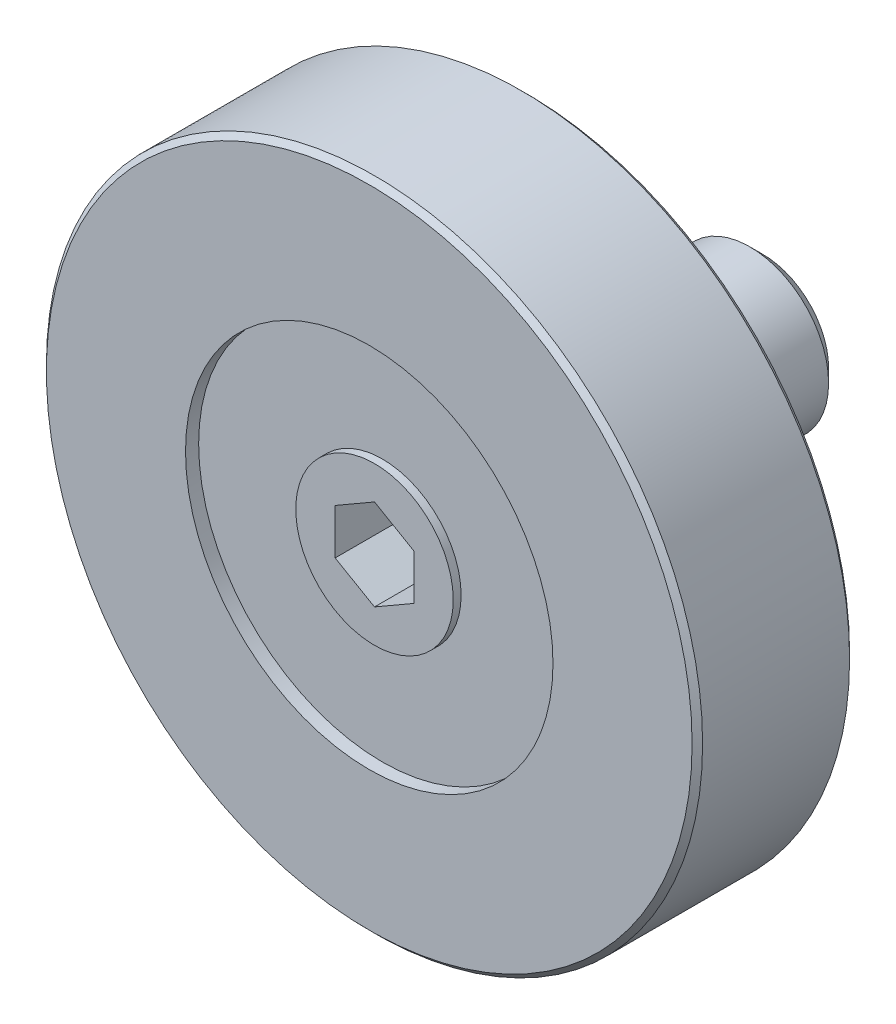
ISO-10303-21;
HEADER;
FILE_DESCRIPTION(('STEP AP214'),'2;1');
FILE_NAME('part.step','',(''),(''),'','','');
FILE_SCHEMA(('AUTOMOTIVE_DESIGN { 1 0 10303 214 1 1 1 1 }'));
ENDSEC;
DATA;
#1=APPLICATION_CONTEXT('core data for automotive mechanical design processes');
#2=APPLICATION_PROTOCOL_DEFINITION('international standard','automotive_design',2000,#1);
#3=PRODUCT_CONTEXT('',#1,'mechanical');
#4=PRODUCT('Part','Part','',(#3));
#5=PRODUCT_RELATED_PRODUCT_CATEGORY('part','',(#4));
#6=PRODUCT_DEFINITION_FORMATION('','',#4);
#7=PRODUCT_DEFINITION_CONTEXT('part definition',#1,'design');
#8=PRODUCT_DEFINITION('design','',#6,#7);
#9=PRODUCT_DEFINITION_SHAPE('','',#8);
#10=(LENGTH_UNIT() NAMED_UNIT(*) SI_UNIT(.MILLI.,.METRE.));
#11=(NAMED_UNIT(*) PLANE_ANGLE_UNIT() SI_UNIT($,.RADIAN.));
#12=(NAMED_UNIT(*) SI_UNIT($,.STERADIAN.) SOLID_ANGLE_UNIT());
#13=UNCERTAINTY_MEASURE_WITH_UNIT(LENGTH_MEASURE(1.E-05),#10,'distance_accuracy_value','');
#14=(GEOMETRIC_REPRESENTATION_CONTEXT(3) GLOBAL_UNCERTAINTY_ASSIGNED_CONTEXT((#13)) GLOBAL_UNIT_ASSIGNED_CONTEXT((#10,
#11,#12)) REPRESENTATION_CONTEXT('',''));
#15=CARTESIAN_POINT('',(0.,0.,0.));
#16=DIRECTION('',(0.,0.,1.));
#17=DIRECTION('',(1.,0.,0.));
#18=AXIS2_PLACEMENT_3D('',#15,#16,#17);
#19=CARTESIAN_POINT('',(0.,0.,-8.00000000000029));
#20=DIRECTION('',(0.,0.,1.));
#21=DIRECTION('',(1.,0.,0.));
#22=AXIS2_PLACEMENT_3D('',#19,#20,#21);
#23=PLANE('',#22);
#24=CARTESIAN_POINT('',(0.,0.,-8.00000000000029));
#25=DIRECTION('',(0.,0.,1.));
#26=DIRECTION('',(1.,0.,0.));
#27=AXIS2_PLACEMENT_3D('',#24,#25,#26);
#28=CIRCLE('',#27,2.49999999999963);
#29=CARTESIAN_POINT('',(2.49999999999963,0.,-8.00000000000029));
#30=VERTEX_POINT('',#29);
#31=EDGE_CURVE('E9',#30,#30,#28,.T.);
#32=ORIENTED_EDGE('',*,*,#31,.F.);
#33=EDGE_LOOP('',(#32));
#34=FACE_BOUND('',#33,.T.);
#35=ADVANCED_FACE('F14',(#34),#23,.F.);
#36=CARTESIAN_POINT('',(0.,0.,-8.00000000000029));
#37=DIRECTION('',(0.,0.,1.));
#38=DIRECTION('',(1.,0.,0.));
#39=AXIS2_PLACEMENT_3D('',#36,#37,#38);
#40=CONICAL_SURFACE('',#39,2.49999999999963,0.785398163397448);
#41=CARTESIAN_POINT('',(0.,0.,-7.50000000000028));
#42=DIRECTION('',(0.,0.,1.));
#43=DIRECTION('',(1.,0.,0.));
#44=AXIS2_PLACEMENT_3D('',#41,#42,#43);
#45=CIRCLE('',#44,2.99999999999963);
#46=CARTESIAN_POINT('',(2.99999999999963,0.,-7.50000000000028));
#47=VERTEX_POINT('',#46);
#48=EDGE_CURVE('E21',#47,#47,#45,.T.);
#49=ORIENTED_EDGE('',*,*,#48,.F.);
#50=EDGE_LOOP('',(#49));
#51=FACE_BOUND('',#50,.T.);
#52=ORIENTED_EDGE('',*,*,#31,.T.);
#53=EDGE_LOOP('',(#52));
#54=FACE_BOUND('',#53,.T.);
#55=ADVANCED_FACE('F169',(#51,#54),#40,.T.);
#56=CARTESIAN_POINT('',(0.,0.,10.));
#57=DIRECTION('',(0.,0.,1.));
#58=DIRECTION('',(1.,0.,0.));
#59=AXIS2_PLACEMENT_3D('',#56,#57,#58);
#60=CYLINDRICAL_SURFACE('',#59,2.99999999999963);
#61=CARTESIAN_POINT('',(0.,0.,-2.00000000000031));
#62=DIRECTION('',(0.,0.,1.));
#63=DIRECTION('',(1.,0.,0.));
#64=AXIS2_PLACEMENT_3D('',#61,#62,#63);
#65=CIRCLE('',#64,2.99999999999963);
#66=CARTESIAN_POINT('',(2.99999999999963,0.,-2.00000000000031));
#67=VERTEX_POINT('',#66);
#68=EDGE_CURVE('E162',#67,#67,#65,.T.);
#69=ORIENTED_EDGE('',*,*,#68,.F.);
#70=EDGE_LOOP('',(#69));
#71=FACE_BOUND('',#70,.T.);
#72=ORIENTED_EDGE('',*,*,#48,.T.);
#73=EDGE_LOOP('',(#72));
#74=FACE_BOUND('',#73,.T.);
#75=ADVANCED_FACE('F167',(#71,#74),#60,.T.);
#76=CARTESIAN_POINT('',(0.,2.34999999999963,-2.00000000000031));
#77=DIRECTION('',(0.,0.,-1.));
#78=DIRECTION('',(-1.,0.,0.));
#79=AXIS2_PLACEMENT_3D('',#76,#77,#78);
#80=PLANE('',#79);
#81=CARTESIAN_POINT('',(0.,0.,-2.00000000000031));
#82=DIRECTION('',(0.,0.,1.));
#83=DIRECTION('',(1.,0.,0.));
#84=AXIS2_PLACEMENT_3D('',#81,#82,#83);
#85=CIRCLE('',#84,2.34999999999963);
#86=CARTESIAN_POINT('',(2.34999999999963,0.,-2.00000000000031));
#87=VERTEX_POINT('',#86);
#88=EDGE_CURVE('E159',#87,#87,#85,.T.);
#89=ORIENTED_EDGE('',*,*,#88,.F.);
#90=EDGE_LOOP('',(#89));
#91=FACE_BOUND('',#90,.T.);
#92=ORIENTED_EDGE('',*,*,#68,.T.);
#93=EDGE_LOOP('',(#92));
#94=FACE_BOUND('',#93,.T.);
#95=ADVANCED_FACE('F194',(#91,#94),#80,.F.);
#96=CARTESIAN_POINT('',(0.,0.,10.));
#97=DIRECTION('',(0.,0.,1.));
#98=DIRECTION('',(1.,0.,0.));
#99=AXIS2_PLACEMENT_3D('',#96,#97,#98);
#100=CYLINDRICAL_SURFACE('',#99,2.34999999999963);
#101=CARTESIAN_POINT('',(0.,0.,-3.05311331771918E-13));
#102=DIRECTION('',(0.,0.,1.));
#103=DIRECTION('',(1.,0.,0.));
#104=AXIS2_PLACEMENT_3D('',#101,#102,#103);
#105=CIRCLE('',#104,2.34999999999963);
#106=CARTESIAN_POINT('',(2.34999999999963,0.,-3.05311331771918E-13));
#107=VERTEX_POINT('',#106);
#108=EDGE_CURVE('E156',#107,#107,#105,.T.);
#109=ORIENTED_EDGE('',*,*,#108,.F.);
#110=EDGE_LOOP('',(#109));
#111=FACE_BOUND('',#110,.T.);
#112=ORIENTED_EDGE('',*,*,#88,.T.);
#113=EDGE_LOOP('',(#112));
#114=FACE_BOUND('',#113,.T.);
#115=ADVANCED_FACE('F203',(#111,#114),#100,.T.);
#116=CARTESIAN_POINT('',(0.,3.99999999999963,-3.05311331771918E-13));
#117=DIRECTION('',(0.,0.,1.));
#118=DIRECTION('',(1.,0.,0.));
#119=AXIS2_PLACEMENT_3D('',#116,#117,#118);
#120=PLANE('',#119);
#121=CARTESIAN_POINT('',(0.,0.,-3.05311331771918E-13));
#122=DIRECTION('',(0.,0.,1.));
#123=DIRECTION('',(1.,0.,0.));
#124=AXIS2_PLACEMENT_3D('',#121,#122,#123);
#125=CIRCLE('',#124,3.99999999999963);
#126=CARTESIAN_POINT('',(3.99999999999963,0.,-3.05311331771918E-13));
#127=VERTEX_POINT('',#126);
#128=EDGE_CURVE('E153',#127,#127,#125,.T.);
#129=ORIENTED_EDGE('',*,*,#128,.F.);
#130=EDGE_LOOP('',(#129));
#131=FACE_BOUND('',#130,.T.);
#132=ORIENTED_EDGE('',*,*,#108,.T.);
#133=EDGE_LOOP('',(#132));
#134=FACE_BOUND('',#133,.T.);
#135=ADVANCED_FACE('F212',(#131,#134),#120,.F.);
#136=CARTESIAN_POINT('',(0.,0.,10.));
#137=DIRECTION('',(0.,0.,1.));
#138=DIRECTION('',(1.,0.,0.));
#139=AXIS2_PLACEMENT_3D('',#136,#137,#138);
#140=CYLINDRICAL_SURFACE('',#139,3.99999999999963);
#141=CARTESIAN_POINT('',(0.,0.,1.49999999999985));
#142=DIRECTION('',(0.,0.,1.));
#143=DIRECTION('',(1.,0.,0.));
#144=AXIS2_PLACEMENT_3D('',#141,#142,#143);
#145=CIRCLE('',#144,3.99999999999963);
#146=CARTESIAN_POINT('',(3.99999999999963,0.,1.49999999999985));
#147=VERTEX_POINT('',#146);
#148=EDGE_CURVE('E150',#147,#147,#145,.T.);
#149=ORIENTED_EDGE('',*,*,#148,.F.);
#150=EDGE_LOOP('',(#149));
#151=FACE_BOUND('',#150,.T.);
#152=ORIENTED_EDGE('',*,*,#128,.T.);
#153=EDGE_LOOP('',(#152));
#154=FACE_BOUND('',#153,.T.);
#155=ADVANCED_FACE('F221',(#151,#154),#140,.T.);
#156=CARTESIAN_POINT('',(0.,3.99999999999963,1.49999999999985));
#157=DIRECTION('',(0.,0.,1.));
#158=DIRECTION('',(1.,0.,0.));
#159=AXIS2_PLACEMENT_3D('',#156,#157,#158);
#160=PLANE('',#159);
#161=CARTESIAN_POINT('',(0.,0.,1.49999999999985));
#162=DIRECTION('',(0.,0.,1.));
#163=DIRECTION('',(1.,0.,0.));
#164=AXIS2_PLACEMENT_3D('',#161,#162,#163);
#165=CIRCLE('',#164,6.99999999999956);
#166=CARTESIAN_POINT('',(6.99999999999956,0.,1.49999999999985));
#167=VERTEX_POINT('',#166);
#168=EDGE_CURVE('E147',#167,#167,#165,.T.);
#169=ORIENTED_EDGE('',*,*,#168,.F.);
#170=EDGE_LOOP('',(#169));
#171=FACE_BOUND('',#170,.T.);
#172=ORIENTED_EDGE('',*,*,#148,.T.);
#173=EDGE_LOOP('',(#172));
#174=FACE_BOUND('',#173,.T.);
#175=ADVANCED_FACE('F230',(#171,#174),#160,.F.);
#176=CARTESIAN_POINT('',(0.,0.,10.));
#177=DIRECTION('',(0.,0.,1.));
#178=DIRECTION('',(1.,0.,0.));
#179=AXIS2_PLACEMENT_3D('',#176,#177,#178);
#180=CYLINDRICAL_SURFACE('',#179,6.99999999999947);
#181=CARTESIAN_POINT('',(0.,0.,0.999999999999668));
#182=DIRECTION('',(0.,0.,1.));
#183=DIRECTION('',(1.,0.,0.));
#184=AXIS2_PLACEMENT_3D('',#181,#182,#183);
#185=CIRCLE('',#184,6.99999999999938);
#186=CARTESIAN_POINT('',(6.99999999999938,0.,0.999999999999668));
#187=VERTEX_POINT('',#186);
#188=EDGE_CURVE('E144',#187,#187,#185,.T.);
#189=ORIENTED_EDGE('',*,*,#188,.F.);
#190=EDGE_LOOP('',(#189));
#191=FACE_BOUND('',#190,.T.);
#192=ORIENTED_EDGE('',*,*,#168,.T.);
#193=EDGE_LOOP('',(#192));
#194=FACE_BOUND('',#193,.T.);
#195=ADVANCED_FACE('F239',(#191,#194),#180,.F.);
#196=CARTESIAN_POINT('',(0.,12.2999999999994,0.999999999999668));
#197=DIRECTION('',(0.,0.,1.));
#198=DIRECTION('',(1.,0.,0.));
#199=AXIS2_PLACEMENT_3D('',#196,#197,#198);
#200=PLANE('',#199);
#201=CARTESIAN_POINT('',(0.,0.,0.999999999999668));
#202=DIRECTION('',(0.,0.,1.));
#203=DIRECTION('',(1.,0.,0.));
#204=AXIS2_PLACEMENT_3D('',#201,#202,#203);
#205=CIRCLE('',#204,12.2999999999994);
#206=CARTESIAN_POINT('',(12.2999999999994,0.,0.999999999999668));
#207=VERTEX_POINT('',#206);
#208=EDGE_CURVE('E141',#207,#207,#205,.T.);
#209=ORIENTED_EDGE('',*,*,#208,.F.);
#210=EDGE_LOOP('',(#209));
#211=FACE_BOUND('',#210,.T.);
#212=ORIENTED_EDGE('',*,*,#188,.T.);
#213=EDGE_LOOP('',(#212));
#214=FACE_BOUND('',#213,.T.);
#215=ADVANCED_FACE('F248',(#211,#214),#200,.F.);
#216=CARTESIAN_POINT('',(0.,0.,0.999999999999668));
#217=DIRECTION('',(0.,0.,1.));
#218=DIRECTION('',(1.,0.,0.));
#219=AXIS2_PLACEMENT_3D('',#216,#217,#218);
#220=CONICAL_SURFACE('',#219,12.2999999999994,0.785398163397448);
#221=CARTESIAN_POINT('',(0.,0.,1.2));
#222=DIRECTION('',(0.,0.,1.));
#223=DIRECTION('',(1.,0.,0.));
#224=AXIS2_PLACEMENT_3D('',#221,#222,#223);
#225=CIRCLE('',#224,12.4999999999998);
#226=CARTESIAN_POINT('',(12.4999999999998,0.,1.2));
#227=VERTEX_POINT('',#226);
#228=EDGE_CURVE('E138',#227,#227,#225,.T.);
#229=ORIENTED_EDGE('',*,*,#228,.F.);
#230=EDGE_LOOP('',(#229));
#231=FACE_BOUND('',#230,.T.);
#232=ORIENTED_EDGE('',*,*,#208,.T.);
#233=EDGE_LOOP('',(#232));
#234=FACE_BOUND('',#233,.T.);
#235=ADVANCED_FACE('F257',(#231,#234),#220,.T.);
#236=CARTESIAN_POINT('',(0.,0.,10.));
#237=DIRECTION('',(0.,0.,1.));
#238=DIRECTION('',(1.,0.,0.));
#239=AXIS2_PLACEMENT_3D('',#236,#237,#238);
#240=CYLINDRICAL_SURFACE('',#239,12.4999999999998);
#241=CARTESIAN_POINT('',(0.,0.,6.8));
#242=DIRECTION('',(0.,0.,1.));
#243=DIRECTION('',(1.,0.,0.));
#244=AXIS2_PLACEMENT_3D('',#241,#242,#243);
#245=CIRCLE('',#244,12.4999999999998);
#246=CARTESIAN_POINT('',(12.4999999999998,0.,6.8));
#247=VERTEX_POINT('',#246);
#248=EDGE_CURVE('E135',#247,#247,#245,.T.);
#249=ORIENTED_EDGE('',*,*,#248,.F.);
#250=EDGE_LOOP('',(#249));
#251=FACE_BOUND('',#250,.T.);
#252=ORIENTED_EDGE('',*,*,#228,.T.);
#253=EDGE_LOOP('',(#252));
#254=FACE_BOUND('',#253,.T.);
#255=ADVANCED_FACE('F266',(#251,#254),#240,.T.);
#256=CARTESIAN_POINT('',(0.,0.,6.8));
#257=DIRECTION('',(0.,0.,-1.));
#258=DIRECTION('',(-1.,0.,0.));
#259=AXIS2_PLACEMENT_3D('',#256,#257,#258);
#260=CONICAL_SURFACE('',#259,12.4999999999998,0.785398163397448);
#261=CARTESIAN_POINT('',(0.,0.,7.));
#262=DIRECTION('',(0.,0.,1.));
#263=DIRECTION('',(1.,0.,0.));
#264=AXIS2_PLACEMENT_3D('',#261,#262,#263);
#265=CIRCLE('',#264,12.2999999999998);
#266=CARTESIAN_POINT('',(12.2999999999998,0.,7.));
#267=VERTEX_POINT('',#266);
#268=EDGE_CURVE('E132',#267,#267,#265,.T.);
#269=ORIENTED_EDGE('',*,*,#268,.F.);
#270=EDGE_LOOP('',(#269));
#271=FACE_BOUND('',#270,.T.);
#272=ORIENTED_EDGE('',*,*,#248,.T.);
#273=EDGE_LOOP('',(#272));
#274=FACE_BOUND('',#273,.T.);
#275=ADVANCED_FACE('F275',(#271,#274),#260,.T.);
#276=CARTESIAN_POINT('',(0.,12.2999999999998,7.));
#277=DIRECTION('',(0.,0.,-1.));
#278=DIRECTION('',(-1.,0.,0.));
#279=AXIS2_PLACEMENT_3D('',#276,#277,#278);
#280=PLANE('',#279);
#281=CARTESIAN_POINT('',(0.,0.,7.));
#282=DIRECTION('',(0.,0.,1.));
#283=DIRECTION('',(1.,0.,0.));
#284=AXIS2_PLACEMENT_3D('',#281,#282,#283);
#285=CIRCLE('',#284,6.99999999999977);
#286=CARTESIAN_POINT('',(6.99999999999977,0.,7.));
#287=VERTEX_POINT('',#286);
#288=EDGE_CURVE('E129',#287,#287,#285,.T.);
#289=ORIENTED_EDGE('',*,*,#288,.F.);
#290=EDGE_LOOP('',(#289));
#291=FACE_BOUND('',#290,.T.);
#292=ORIENTED_EDGE('',*,*,#268,.T.);
#293=EDGE_LOOP('',(#292));
#294=FACE_BOUND('',#293,.T.);
#295=ADVANCED_FACE('F284',(#291,#294),#280,.F.);
#296=CARTESIAN_POINT('',(0.,0.,10.));
#297=DIRECTION('',(0.,0.,1.));
#298=DIRECTION('',(1.,0.,0.));
#299=AXIS2_PLACEMENT_3D('',#296,#297,#298);
#300=CYLINDRICAL_SURFACE('',#299,6.99999999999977);
#301=CARTESIAN_POINT('',(0.,0.,6.5));
#302=DIRECTION('',(0.,0.,1.));
#303=DIRECTION('',(1.,0.,0.));
#304=AXIS2_PLACEMENT_3D('',#301,#302,#303);
#305=CIRCLE('',#304,6.99999999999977);
#306=CARTESIAN_POINT('',(6.99999999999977,0.,6.5));
#307=VERTEX_POINT('',#306);
#308=EDGE_CURVE('E126',#307,#307,#305,.T.);
#309=ORIENTED_EDGE('',*,*,#308,.F.);
#310=EDGE_LOOP('',(#309));
#311=FACE_BOUND('',#310,.T.);
#312=ORIENTED_EDGE('',*,*,#288,.T.);
#313=EDGE_LOOP('',(#312));
#314=FACE_BOUND('',#313,.T.);
#315=ADVANCED_FACE('F293',(#311,#314),#300,.F.);
#316=CARTESIAN_POINT('',(0.,3.,6.5));
#317=DIRECTION('',(0.,0.,-1.));
#318=DIRECTION('',(-1.,0.,0.));
#319=AXIS2_PLACEMENT_3D('',#316,#317,#318);
#320=PLANE('',#319);
#321=CARTESIAN_POINT('',(0.,0.,6.5));
#322=DIRECTION('',(0.,0.,1.));
#323=DIRECTION('',(1.,0.,0.));
#324=AXIS2_PLACEMENT_3D('',#321,#322,#323);
#325=CIRCLE('',#324,3.);
#326=CARTESIAN_POINT('',(3.,0.,6.5));
#327=VERTEX_POINT('',#326);
#328=EDGE_CURVE('E123',#327,#327,#325,.T.);
#329=ORIENTED_EDGE('',*,*,#328,.F.);
#330=EDGE_LOOP('',(#329));
#331=FACE_BOUND('',#330,.T.);
#332=ORIENTED_EDGE('',*,*,#308,.T.);
#333=EDGE_LOOP('',(#332));
#334=FACE_BOUND('',#333,.T.);
#335=ADVANCED_FACE('F302',(#331,#334),#320,.F.);
#336=CARTESIAN_POINT('',(0.,0.,10.));
#337=DIRECTION('',(0.,0.,1.));
#338=DIRECTION('',(1.,0.,0.));
#339=AXIS2_PLACEMENT_3D('',#336,#337,#338);
#340=CYLINDRICAL_SURFACE('',#339,3.);
#341=CARTESIAN_POINT('',(0.,0.,6.8));
#342=DIRECTION('',(0.,0.,1.));
#343=DIRECTION('',(1.,0.,0.));
#344=AXIS2_PLACEMENT_3D('',#341,#342,#343);
#345=CIRCLE('',#344,3.);
#346=CARTESIAN_POINT('',(3.,0.,6.8));
#347=VERTEX_POINT('',#346);
#348=EDGE_CURVE('E115',#347,#347,#345,.T.);
#349=ORIENTED_EDGE('',*,*,#348,.F.);
#350=EDGE_LOOP('',(#349));
#351=FACE_BOUND('',#350,.T.);
#352=ORIENTED_EDGE('',*,*,#328,.T.);
#353=EDGE_LOOP('',(#352));
#354=FACE_BOUND('',#353,.T.);
#355=ADVANCED_FACE('F311',(#351,#354),#340,.T.);
#356=CARTESIAN_POINT('',(0.,3.,6.8));
#357=DIRECTION('',(0.,0.,-1.));
#358=DIRECTION('',(-1.,0.,0.));
#359=AXIS2_PLACEMENT_3D('',#356,#357,#358);
#360=PLANE('',#359);
#361=DIRECTION('',(-0.866025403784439,-0.5,0.));
#362=VECTOR('',#361,1.);
#363=CARTESIAN_POINT('',(0.,1.73205080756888,6.8));
#364=LINE('',#363,#362);
#365=CARTESIAN_POINT('',(0.,1.73205080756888,6.8));
#366=VERTEX_POINT('',#365);
#367=CARTESIAN_POINT('',(-1.5,0.86602540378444,6.8));
#368=VERTEX_POINT('',#367);
#369=EDGE_CURVE('E102',#366,#368,#364,.T.);
#370=ORIENTED_EDGE('',*,*,#369,.F.);
#371=DIRECTION('',(-0.866025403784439,0.5,0.));
#372=VECTOR('',#371,1.);
#373=CARTESIAN_POINT('',(1.5,0.86602540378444,6.8));
#374=LINE('',#373,#372);
#375=CARTESIAN_POINT('',(1.5,0.86602540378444,6.8));
#376=VERTEX_POINT('',#375);
#377=EDGE_CURVE('E28',#376,#366,#374,.T.);
#378=ORIENTED_EDGE('',*,*,#377,.F.);
#379=DIRECTION('',(0.,1.,0.));
#380=VECTOR('',#379,1.);
#381=CARTESIAN_POINT('',(1.5,-0.866025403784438,6.8));
#382=LINE('',#381,#380);
#383=CARTESIAN_POINT('',(1.5,-0.866025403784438,6.8));
#384=VERTEX_POINT('',#383);
#385=EDGE_CURVE('E111',#384,#376,#382,.T.);
#386=ORIENTED_EDGE('',*,*,#385,.F.);
#387=DIRECTION('',(0.866025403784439,0.5,0.));
#388=VECTOR('',#387,1.);
#389=CARTESIAN_POINT('',(0.,-1.73205080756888,6.8));
#390=LINE('',#389,#388);
#391=CARTESIAN_POINT('',(0.,-1.73205080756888,6.8));
#392=VERTEX_POINT('',#391);
#393=EDGE_CURVE('E109',#392,#384,#390,.T.);
#394=ORIENTED_EDGE('',*,*,#393,.F.);
#395=DIRECTION('',(0.866025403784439,-0.5,0.));
#396=VECTOR('',#395,1.);
#397=CARTESIAN_POINT('',(-1.5,-0.866025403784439,6.8));
#398=LINE('',#397,#396);
#399=CARTESIAN_POINT('',(-1.5,-0.866025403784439,6.8));
#400=VERTEX_POINT('',#399);
#401=EDGE_CURVE('E76',#400,#392,#398,.T.);
#402=ORIENTED_EDGE('',*,*,#401,.F.);
#403=DIRECTION('',(0.,-1.,0.));
#404=VECTOR('',#403,1.);
#405=CARTESIAN_POINT('',(-1.5,0.86602540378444,6.8));
#406=LINE('',#405,#404);
#407=EDGE_CURVE('E105',#368,#400,#406,.T.);
#408=ORIENTED_EDGE('',*,*,#407,.F.);
#409=EDGE_LOOP('',(#370,#378,#386,#394,#402,#408));
#410=FACE_BOUND('',#409,.T.);
#411=ORIENTED_EDGE('',*,*,#348,.T.);
#412=EDGE_LOOP('',(#411));
#413=FACE_BOUND('',#412,.T.);
#414=ADVANCED_FACE('F320',(#410,#413),#360,.F.);
#415=CARTESIAN_POINT('',(1.5,0.86602540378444,4.3));
#416=DIRECTION('',(0.5,0.866025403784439,0.));
#417=DIRECTION('',(-0.866025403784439,0.5,0.));
#418=AXIS2_PLACEMENT_3D('',#415,#416,#417);
#419=PLANE('',#418);
#420=ORIENTED_EDGE('',*,*,#377,.T.);
#421=DIRECTION('',(0.,0.,1.));
#422=VECTOR('',#421,1.);
#423=CARTESIAN_POINT('',(0.,1.73205080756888,4.3));
#424=LINE('',#423,#422);
#425=CARTESIAN_POINT('',(0.,1.73205080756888,4.3));
#426=VERTEX_POINT('',#425);
#427=EDGE_CURVE('E58',#426,#366,#424,.T.);
#428=ORIENTED_EDGE('',*,*,#427,.F.);
#429=DIRECTION('',(-0.866025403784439,0.5,0.));
#430=VECTOR('',#429,1.);
#431=CARTESIAN_POINT('',(1.5,0.86602540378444,4.3));
#432=LINE('',#431,#430);
#433=CARTESIAN_POINT('',(1.5,0.86602540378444,4.3));
#434=VERTEX_POINT('',#433);
#435=EDGE_CURVE('E113',#434,#426,#432,.T.);
#436=ORIENTED_EDGE('',*,*,#435,.F.);
#437=DIRECTION('',(0.,0.,1.));
#438=VECTOR('',#437,1.);
#439=CARTESIAN_POINT('',(1.5,0.86602540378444,4.3));
#440=LINE('',#439,#438);
#441=EDGE_CURVE('E36',#434,#376,#440,.T.);
#442=ORIENTED_EDGE('',*,*,#441,.T.);
#443=EDGE_LOOP('',(#420,#428,#436,#442));
#444=FACE_BOUND('',#443,.T.);
#445=ADVANCED_FACE('F329',(#444),#419,.F.);
#446=CARTESIAN_POINT('',(1.5,-0.866025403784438,4.3));
#447=DIRECTION('',(1.,0.,0.));
#448=DIRECTION('',(0.,1.,0.));
#449=AXIS2_PLACEMENT_3D('',#446,#447,#448);
#450=PLANE('',#449);
#451=ORIENTED_EDGE('',*,*,#385,.T.);
#452=ORIENTED_EDGE('',*,*,#441,.F.);
#453=DIRECTION('',(0.,1.,0.));
#454=VECTOR('',#453,1.);
#455=CARTESIAN_POINT('',(1.5,-0.866025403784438,4.3));
#456=LINE('',#455,#454);
#457=CARTESIAN_POINT('',(1.5,-0.866025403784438,4.3));
#458=VERTEX_POINT('',#457);
#459=EDGE_CURVE('E88',#458,#434,#456,.T.);
#460=ORIENTED_EDGE('',*,*,#459,.F.);
#461=DIRECTION('',(0.,0.,1.));
#462=VECTOR('',#461,1.);
#463=CARTESIAN_POINT('',(1.5,-0.866025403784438,4.3));
#464=LINE('',#463,#462);
#465=EDGE_CURVE('E80',#458,#384,#464,.T.);
#466=ORIENTED_EDGE('',*,*,#465,.T.);
#467=EDGE_LOOP('',(#451,#452,#460,#466));
#468=FACE_BOUND('',#467,.T.);
#469=ADVANCED_FACE('F338',(#468),#450,.F.);
#470=CARTESIAN_POINT('',(0.,-1.73205080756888,4.3));
#471=DIRECTION('',(0.5,-0.866025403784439,0.));
#472=DIRECTION('',(0.866025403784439,0.5,0.));
#473=AXIS2_PLACEMENT_3D('',#470,#471,#472);
#474=PLANE('',#473);
#475=ORIENTED_EDGE('',*,*,#393,.T.);
#476=ORIENTED_EDGE('',*,*,#465,.F.);
#477=DIRECTION('',(0.866025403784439,0.5,0.));
#478=VECTOR('',#477,1.);
#479=CARTESIAN_POINT('',(0.,-1.73205080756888,4.3));
#480=LINE('',#479,#478);
#481=CARTESIAN_POINT('',(0.,-1.73205080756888,4.3));
#482=VERTEX_POINT('',#481);
#483=EDGE_CURVE('E84',#482,#458,#480,.T.);
#484=ORIENTED_EDGE('',*,*,#483,.F.);
#485=DIRECTION('',(0.,0.,1.));
#486=VECTOR('',#485,1.);
#487=CARTESIAN_POINT('',(0.,-1.73205080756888,4.3));
#488=LINE('',#487,#486);
#489=EDGE_CURVE('E69',#482,#392,#488,.T.);
#490=ORIENTED_EDGE('',*,*,#489,.T.);
#491=EDGE_LOOP('',(#475,#476,#484,#490));
#492=FACE_BOUND('',#491,.T.);
#493=ADVANCED_FACE('F85',(#492),#474,.F.);
#494=CARTESIAN_POINT('',(-1.5,-0.866025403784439,4.3));
#495=DIRECTION('',(-0.5,-0.866025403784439,0.));
#496=DIRECTION('',(0.866025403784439,-0.5,0.));
#497=AXIS2_PLACEMENT_3D('',#494,#495,#496);
#498=PLANE('',#497);
#499=ORIENTED_EDGE('',*,*,#401,.T.);
#500=ORIENTED_EDGE('',*,*,#489,.F.);
#501=DIRECTION('',(0.866025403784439,-0.5,0.));
#502=VECTOR('',#501,1.);
#503=CARTESIAN_POINT('',(-1.5,-0.866025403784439,4.3));
#504=LINE('',#503,#502);
#505=CARTESIAN_POINT('',(-1.5,-0.866025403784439,4.3));
#506=VERTEX_POINT('',#505);
#507=EDGE_CURVE('E73',#506,#482,#504,.T.);
#508=ORIENTED_EDGE('',*,*,#507,.F.);
#509=DIRECTION('',(0.,0.,1.));
#510=VECTOR('',#509,1.);
#511=CARTESIAN_POINT('',(-1.5,-0.866025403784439,4.3));
#512=LINE('',#511,#510);
#513=EDGE_CURVE('E81',#506,#400,#512,.T.);
#514=ORIENTED_EDGE('',*,*,#513,.T.);
#515=EDGE_LOOP('',(#499,#500,#508,#514));
#516=FACE_BOUND('',#515,.T.);
#517=ADVANCED_FACE('F71',(#516),#498,.F.);
#518=CARTESIAN_POINT('',(-1.5,0.86602540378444,4.3));
#519=DIRECTION('',(-1.,0.,0.));
#520=DIRECTION('',(0.,-1.,0.));
#521=AXIS2_PLACEMENT_3D('',#518,#519,#520);
#522=PLANE('',#521);
#523=ORIENTED_EDGE('',*,*,#407,.T.);
#524=ORIENTED_EDGE('',*,*,#513,.F.);
#525=DIRECTION('',(0.,-1.,0.));
#526=VECTOR('',#525,1.);
#527=CARTESIAN_POINT('',(-1.5,0.86602540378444,4.3));
#528=LINE('',#527,#526);
#529=CARTESIAN_POINT('',(-1.5,0.86602540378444,4.3));
#530=VERTEX_POINT('',#529);
#531=EDGE_CURVE('E94',#530,#506,#528,.T.);
#532=ORIENTED_EDGE('',*,*,#531,.F.);
#533=DIRECTION('',(0.,0.,1.));
#534=VECTOR('',#533,1.);
#535=CARTESIAN_POINT('',(-1.5,0.86602540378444,4.3));
#536=LINE('',#535,#534);
#537=EDGE_CURVE('E118',#530,#368,#536,.T.);
#538=ORIENTED_EDGE('',*,*,#537,.T.);
#539=EDGE_LOOP('',(#523,#524,#532,#538));
#540=FACE_BOUND('',#539,.T.);
#541=ADVANCED_FACE('F360',(#540),#522,.F.);
#542=CARTESIAN_POINT('',(0.,1.73205080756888,4.3));
#543=DIRECTION('',(-0.5,0.866025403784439,0.));
#544=DIRECTION('',(-0.866025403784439,-0.5,0.));
#545=AXIS2_PLACEMENT_3D('',#542,#543,#544);
#546=PLANE('',#545);
#547=ORIENTED_EDGE('',*,*,#369,.T.);
#548=ORIENTED_EDGE('',*,*,#537,.F.);
#549=DIRECTION('',(-0.866025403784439,-0.5,0.));
#550=VECTOR('',#549,1.);
#551=CARTESIAN_POINT('',(0.,1.73205080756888,4.3));
#552=LINE('',#551,#550);
#553=EDGE_CURVE('E96',#426,#530,#552,.T.);
#554=ORIENTED_EDGE('',*,*,#553,.F.);
#555=ORIENTED_EDGE('',*,*,#427,.T.);
#556=EDGE_LOOP('',(#547,#548,#554,#555));
#557=FACE_BOUND('',#556,.T.);
#558=ADVANCED_FACE('F368',(#557),#546,.F.);
#559=CARTESIAN_POINT('',(0.,0.,4.3));
#560=DIRECTION('',(0.,0.,1.));
#561=DIRECTION('',(1.,0.,0.));
#562=AXIS2_PLACEMENT_3D('',#559,#560,#561);
#563=PLANE('',#562);
#564=ORIENTED_EDGE('',*,*,#435,.T.);
#565=ORIENTED_EDGE('',*,*,#553,.T.);
#566=ORIENTED_EDGE('',*,*,#531,.T.);
#567=ORIENTED_EDGE('',*,*,#507,.T.);
#568=ORIENTED_EDGE('',*,*,#483,.T.);
#569=ORIENTED_EDGE('',*,*,#459,.T.);
#570=EDGE_LOOP('',(#564,#565,#566,#567,#568,#569));
#571=FACE_BOUND('',#570,.T.);
#572=ADVANCED_FACE('F91',(#571),#563,.T.);
#573=CLOSED_SHELL('',(#35,#55,#75,#95,#115,#135,#155,#175,#195,#215,#235,#255,#275,#295,#315,
#335,#355,#414,#445,#469,#493,#517,#541,#558,#572));
#574=MANIFOLD_SOLID_BREP('B1',#573);
#575=ADVANCED_BREP_SHAPE_REPRESENTATION('',(#18,#574),#14);
#576=SHAPE_DEFINITION_REPRESENTATION(#9,#575);
ENDSEC;
END-ISO-10303-21;
